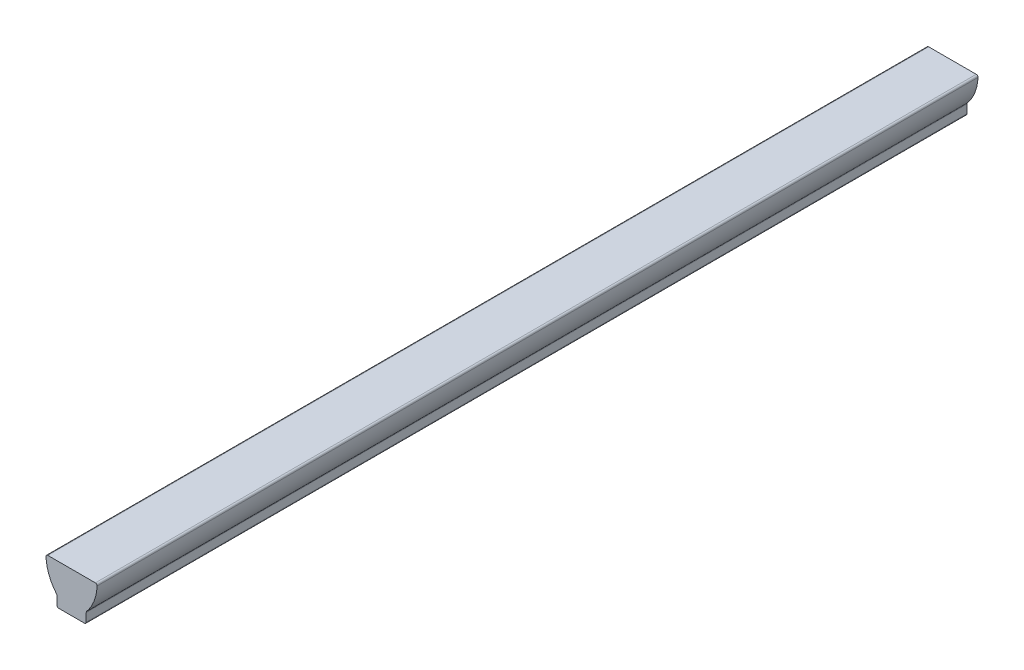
ISO-10303-21;
HEADER;
FILE_DESCRIPTION(('STEP AP214'),'2;1');
FILE_NAME('part.step','',(''),(''),'','','');
FILE_SCHEMA(('AUTOMOTIVE_DESIGN { 1 0 10303 214 1 1 1 1 }'));
ENDSEC;
DATA;
#1=APPLICATION_CONTEXT('core data for automotive mechanical design processes');
#2=APPLICATION_PROTOCOL_DEFINITION('international standard','automotive_design',2000,#1);
#3=PRODUCT_CONTEXT('',#1,'mechanical');
#4=PRODUCT('Part','Part','',(#3));
#5=PRODUCT_RELATED_PRODUCT_CATEGORY('part','',(#4));
#6=PRODUCT_DEFINITION_FORMATION('','',#4);
#7=PRODUCT_DEFINITION_CONTEXT('part definition',#1,'design');
#8=PRODUCT_DEFINITION('design','',#6,#7);
#9=PRODUCT_DEFINITION_SHAPE('','',#8);
#10=(LENGTH_UNIT() NAMED_UNIT(*) SI_UNIT(.MILLI.,.METRE.));
#11=(NAMED_UNIT(*) PLANE_ANGLE_UNIT() SI_UNIT($,.RADIAN.));
#12=(NAMED_UNIT(*) SI_UNIT($,.STERADIAN.) SOLID_ANGLE_UNIT());
#13=UNCERTAINTY_MEASURE_WITH_UNIT(LENGTH_MEASURE(1.E-05),#10,'distance_accuracy_value','');
#14=(GEOMETRIC_REPRESENTATION_CONTEXT(3) GLOBAL_UNCERTAINTY_ASSIGNED_CONTEXT((#13)) GLOBAL_UNIT_ASSIGNED_CONTEXT((#10,
#11,#12)) REPRESENTATION_CONTEXT('',''));
#15=CARTESIAN_POINT('',(0.,0.,0.));
#16=DIRECTION('',(0.,0.,1.));
#17=DIRECTION('',(1.,0.,0.));
#18=AXIS2_PLACEMENT_3D('',#15,#16,#17);
#19=CARTESIAN_POINT('',(-3.55599995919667,-5.0532017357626,190.5));
#20=DIRECTION('',(0.,0.,-1.));
#21=DIRECTION('',(-1.,0.,0.));
#22=AXIS2_PLACEMENT_3D('',#19,#20,#21);
#23=CYLINDRICAL_SURFACE('',#22,0.380999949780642);
#24=DIRECTION('',(0.,0.,1.));
#25=VECTOR('',#24,1.);
#26=CARTESIAN_POINT('',(-3.17500000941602,-5.0532017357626,95.25));
#27=LINE('',#26,#25);
#28=CARTESIAN_POINT('',(-3.17500000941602,-5.0532017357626,0.));
#29=VERTEX_POINT('',#28);
#30=CARTESIAN_POINT('',(-3.17500000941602,-5.0532017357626,190.5));
#31=VERTEX_POINT('',#30);
#32=EDGE_CURVE('E115',#29,#31,#27,.T.);
#33=ORIENTED_EDGE('',*,*,#32,.T.);
#34=CARTESIAN_POINT('',(-3.55599995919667,-5.0532017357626,190.5));
#35=DIRECTION('',(0.,0.,-1.));
#36=DIRECTION('',(-1.,0.,0.));
#37=AXIS2_PLACEMENT_3D('',#34,#35,#36);
#38=CIRCLE('',#37,0.380999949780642);
#39=CARTESIAN_POINT('',(-3.26353491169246,-4.80901908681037,190.5));
#40=VERTEX_POINT('',#39);
#41=EDGE_CURVE('E18',#40,#31,#38,.T.);
#42=ORIENTED_EDGE('',*,*,#41,.F.);
#43=DIRECTION('',(0.,0.,-1.));
#44=VECTOR('',#43,1.);
#45=CARTESIAN_POINT('',(-3.26353490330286,-4.8090190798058,95.25));
#46=LINE('',#45,#44);
#47=CARTESIAN_POINT('',(-3.26353491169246,-4.80901908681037,0.));
#48=VERTEX_POINT('',#47);
#49=EDGE_CURVE('E120',#40,#48,#46,.T.);
#50=ORIENTED_EDGE('',*,*,#49,.T.);
#51=CARTESIAN_POINT('',(-3.55599995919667,-5.0532017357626,0.));
#52=DIRECTION('',(0.,0.,-1.));
#53=DIRECTION('',(-1.,0.,0.));
#54=AXIS2_PLACEMENT_3D('',#51,#52,#53);
#55=CIRCLE('',#54,0.380999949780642);
#56=EDGE_CURVE('E113',#29,#48,#55,.F.);
#57=ORIENTED_EDGE('',*,*,#56,.F.);
#58=EDGE_LOOP('',(#33,#42,#50,#57));
#59=FACE_BOUND('',#58,.T.);
#60=ADVANCED_FACE('F14',(#59),#23,.F.);
#61=CARTESIAN_POINT('',(-2.79400000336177,-7.2757636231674,190.5));
#62=CARTESIAN_POINT('',(-2.84452374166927,-7.2757636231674,190.5));
#63=CARTESIAN_POINT('',(-2.89312454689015,-7.26609633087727,190.5));
#64=CARTESIAN_POINT('',(-2.93980239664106,-7.2467617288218,190.5));
#65=CARTESIAN_POINT('',(-2.98648024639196,-7.22742712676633,190.5));
#66=CARTESIAN_POINT('',(-3.02768201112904,-7.19989697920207,190.5));
#67=CARTESIAN_POINT('',(-3.0634076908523,-7.1641713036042,190.5));
#68=CARTESIAN_POINT('',(-3.09913337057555,-7.12844562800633,190.5));
#69=CARTESIAN_POINT('',(-3.12666351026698,-7.0872438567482,190.5));
#70=CARTESIAN_POINT('',(-3.1459981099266,-7.040566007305,190.5));
#71=CARTESIAN_POINT('',(-3.16533270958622,-6.9938881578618,190.5));
#72=CARTESIAN_POINT('',(-3.17500000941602,-6.9452873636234,190.5));
#73=CARTESIAN_POINT('',(-3.17500000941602,-6.8947636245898,190.5));
#74=CARTESIAN_POINT('',(-2.79400000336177,-7.2757636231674,0.));
#75=CARTESIAN_POINT('',(-2.84452374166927,-7.2757636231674,0.));
#76=CARTESIAN_POINT('',(-2.89312454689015,-7.26609633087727,0.));
#77=CARTESIAN_POINT('',(-2.93980239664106,-7.2467617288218,0.));
#78=CARTESIAN_POINT('',(-2.98648024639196,-7.22742712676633,0.));
#79=CARTESIAN_POINT('',(-3.02768201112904,-7.19989697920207,0.));
#80=CARTESIAN_POINT('',(-3.0634076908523,-7.1641713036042,0.));
#81=CARTESIAN_POINT('',(-3.09913337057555,-7.12844562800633,0.));
#82=CARTESIAN_POINT('',(-3.12666351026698,-7.0872438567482,0.));
#83=CARTESIAN_POINT('',(-3.1459981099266,-7.040566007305,0.));
#84=CARTESIAN_POINT('',(-3.16533270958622,-6.9938881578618,0.));
#85=CARTESIAN_POINT('',(-3.17500000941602,-6.9452873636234,0.));
#86=CARTESIAN_POINT('',(-3.17500000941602,-6.8947636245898,0.));
#87=B_SPLINE_SURFACE_WITH_KNOTS('',1,3,((#61,#62,#63,#64,#65,#66,#67,#68,#69,#70,#71,#72,#73),
(#74,#75,#76,#77,#78,#79,#80,#81,#82,#83,#84,#85,#86)),.UNSPECIFIED.,.F.,.F.,.F.,(2,2),(4,3,3,3,
4),(0.,1.),(0.,0.25,0.5,0.75,1.),.UNSPECIFIED.);
#88=DIRECTION('',(0.,0.,1.));
#89=VECTOR('',#88,1.);
#90=CARTESIAN_POINT('',(-2.79400000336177,-7.2757636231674,95.25));
#91=LINE('',#90,#89);
#92=CARTESIAN_POINT('',(-2.79400000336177,-7.2757636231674,0.));
#93=VERTEX_POINT('',#92);
#94=CARTESIAN_POINT('',(-2.79400000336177,-7.2757636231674,190.5));
#95=VERTEX_POINT('',#94);
#96=EDGE_CURVE('E152',#93,#95,#91,.T.);
#97=CARTESIAN_POINT('',(-3.17500000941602,-6.8947636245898,190.5));
#98=CARTESIAN_POINT('',(-3.17500459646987,-6.90550721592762,190.5));
#99=CARTESIAN_POINT('',(-3.17456316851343,-6.91625275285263,190.5));
#100=CARTESIAN_POINT('',(-3.1727767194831,-6.93766409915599,190.5));
#101=CARTESIAN_POINT('',(-3.17143203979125,-6.94832993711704,190.5));
#102=CARTESIAN_POINT('',(-3.16782862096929,-6.96950018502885,190.5));
#103=CARTESIAN_POINT('',(-3.16557042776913,-6.98000468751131,190.5));
#104=CARTESIAN_POINT('',(-3.16016026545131,-7.00078144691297,190.5));
#105=CARTESIAN_POINT('',(-3.15700819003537,-7.01105367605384,190.5));
#106=CARTESIAN_POINT('',(-3.14986010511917,-7.03130096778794,190.5));
#107=CARTESIAN_POINT('',(-3.14586402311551,-7.04127600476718,190.5));
#108=CARTESIAN_POINT('',(-3.1370710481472,-7.06086342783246,190.5));
#109=CARTESIAN_POINT('',(-3.13227420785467,-7.07047583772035,190.5));
#110=CARTESIAN_POINT('',(-3.11666703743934,-7.09863357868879,190.5));
#111=CARTESIAN_POINT('',(-3.10463268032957,-7.11652064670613,190.5));
#112=CARTESIAN_POINT('',(-3.07776337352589,-7.14995261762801,190.5));
#113=CARTESIAN_POINT('',(-3.06293512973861,-7.16550297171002,190.5));
#114=CARTESIAN_POINT('',(-3.03090748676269,-7.19395789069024,190.5));
#115=CARTESIAN_POINT('',(-3.01370753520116,-7.20686183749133,190.5));
#116=CARTESIAN_POINT('',(-2.9772921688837,-7.22953660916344,190.5));
#117=CARTESIAN_POINT('',(-2.95807117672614,-7.23929844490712,190.5));
#118=CARTESIAN_POINT('',(-2.91830204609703,-7.2555552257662,190.5));
#119=CARTESIAN_POINT('',(-2.89775477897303,-7.2620522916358,190.5));
#120=CARTESIAN_POINT('',(-2.86322192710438,-7.26975959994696,190.5));
#121=CARTESIAN_POINT('',(-2.84946549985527,-7.27202515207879,190.5));
#122=CARTESIAN_POINT('',(-2.82180573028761,-7.27503135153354,190.5));
#123=CARTESIAN_POINT('',(-2.80790261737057,-7.27577410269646,190.5));
#124=CARTESIAN_POINT('',(-2.79400000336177,-7.2757636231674,190.5));
#125=B_SPLINE_CURVE_WITH_KNOTS('',3,(#97,#98,#99,#100,#101,#102,#103,#104,#105,#106,#107,#108,
#109,#110,#111,#112,#113,#114,#115,#116,#117,#118,#119,#120,#121,#122,#123,#124),.UNSPECIFIED.,
.F.,.F.,(4,2,2,2,2,2,2,2,2,2,2,2,2,4),(0.,0.0322242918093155,0.0644364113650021,
0.0966293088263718,0.128826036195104,0.16102553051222,0.19322290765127,0.257551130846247,
0.321726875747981,0.385917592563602,0.450290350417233,0.514621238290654,0.556364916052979,
0.598050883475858),.UNSPECIFIED.);
#126=CARTESIAN_POINT('',(-3.17500000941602,-6.8947636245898,190.5));
#127=VERTEX_POINT('',#126);
#128=EDGE_CURVE('E264',#127,#95,#125,.T.);
#129=DIRECTION('',(0.,0.,-1.));
#130=VECTOR('',#129,1.);
#131=CARTESIAN_POINT('',(-3.17500000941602,-6.8947636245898,95.25));
#132=LINE('',#131,#130);
#133=CARTESIAN_POINT('',(-3.17500000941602,-6.8947636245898,0.));
#134=VERTEX_POINT('',#133);
#135=EDGE_CURVE('E119',#127,#134,#132,.T.);
#136=CARTESIAN_POINT('',(-2.79400000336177,-7.2757636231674,0.));
#137=CARTESIAN_POINT('',(-2.80474359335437,-7.27576821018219,0.));
#138=CARTESIAN_POINT('',(-2.81548912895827,-7.27532678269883,0.));
#139=CARTESIAN_POINT('',(-2.83690047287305,-7.27354033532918,0.));
#140=CARTESIAN_POINT('',(-2.84756630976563,-7.27219565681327,0.));
#141=CARTESIAN_POINT('',(-2.8687365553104,-7.26859224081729,0.));
#142=CARTESIAN_POINT('',(-2.87924105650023,-7.26633404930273,0.));
#143=CARTESIAN_POINT('',(-2.90001781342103,-7.26092389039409,0.));
#144=CARTESIAN_POINT('',(-2.91029004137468,-7.2577718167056,0.));
#145=CARTESIAN_POINT('',(-2.93053733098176,-7.25062373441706,0.));
#146=CARTESIAN_POINT('',(-2.94051236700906,-7.24662765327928,0.));
#147=CARTESIAN_POINT('',(-2.9600997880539,-7.23783467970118,0.));
#148=CARTESIAN_POINT('',(-2.96971219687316,-7.23303783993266,0.));
#149=CARTESIAN_POINT('',(-2.99786993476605,-7.21743067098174,0.));
#150=CARTESIAN_POINT('',(-3.01575700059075,-7.20539631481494,0.));
#151=CARTESIAN_POINT('',(-3.04918897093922,-7.17852701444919,0.));
#152=CARTESIAN_POINT('',(-3.06473932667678,-7.16369877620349,0.));
#153=CARTESIAN_POINT('',(-3.09319424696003,-7.13167114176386,0.));
#154=CARTESIAN_POINT('',(-3.10609819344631,-7.11447119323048,0.));
#155=CARTESIAN_POINT('',(-3.12877296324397,-7.0780558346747,0.));
#156=CARTESIAN_POINT('',(-3.13853479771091,-7.05883484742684,0.));
#157=CARTESIAN_POINT('',(-3.15479158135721,-7.01906572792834,0.));
#158=CARTESIAN_POINT('',(-3.16128865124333,-6.99851846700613,0.));
#159=CARTESIAN_POINT('',(-3.16899597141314,-6.96398560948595,0.));
#160=CARTESIAN_POINT('',(-3.17126152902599,-6.9502291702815,0.));
#161=CARTESIAN_POINT('',(-3.17426773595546,-6.92256937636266,0.));
#162=CARTESIAN_POINT('',(-3.1750104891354,-6.90866625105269,0.));
#163=CARTESIAN_POINT('',(-3.17500000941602,-6.8947636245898,0.));
#164=B_SPLINE_CURVE_WITH_KNOTS('',3,(#136,#137,#138,#139,#140,#141,#142,#143,#144,#145,#146,
#147,#148,#149,#150,#151,#152,#153,#154,#155,#156,#157,#158,#159,#160,#161,#162,#163),
.UNSPECIFIED.,.F.,.F.,(4,2,2,2,2,2,2,2,2,2,2,2,2,4),(0.,0.0322242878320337,0.0644364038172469,
0.0966292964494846,0.128826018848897,0.161025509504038,0.193222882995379,0.257551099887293,
0.321726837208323,0.385917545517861,0.450290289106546,0.514621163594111,0.556364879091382,
0.598050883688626),.UNSPECIFIED.);
#165=EDGE_CURVE('E258',#93,#134,#164,.T.);
#166=ORIENTED_EDGE('',*,*,#96,.T.);
#167=ORIENTED_EDGE('',*,*,#128,.F.);
#168=ORIENTED_EDGE('',*,*,#135,.T.);
#169=ORIENTED_EDGE('',*,*,#165,.F.);
#170=EDGE_LOOP('',(#166,#167,#168,#169));
#171=FACE_BOUND('',#170,.T.);
#172=ADVANCED_FACE('F233',(#171),#87,.F.);
#173=CARTESIAN_POINT('',(3.17500000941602,-6.8947636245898,190.5));
#174=CARTESIAN_POINT('',(3.17500000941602,-6.9452873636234,190.5));
#175=CARTESIAN_POINT('',(3.16533270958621,-6.99388815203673,190.5));
#176=CARTESIAN_POINT('',(3.1459981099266,-7.040566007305,190.5));
#177=CARTESIAN_POINT('',(3.12666351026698,-7.08724386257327,190.5));
#178=CARTESIAN_POINT('',(3.09913337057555,-7.12844562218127,190.5));
#179=CARTESIAN_POINT('',(3.0634076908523,-7.1641713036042,190.5));
#180=CARTESIAN_POINT('',(3.02768201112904,-7.19989698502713,190.5));
#181=CARTESIAN_POINT('',(2.98648025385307,-7.2274271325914,190.5));
#182=CARTESIAN_POINT('',(2.93980239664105,-7.2467617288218,190.5));
#183=CARTESIAN_POINT('',(2.89312453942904,-7.2660963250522,190.5));
#184=CARTESIAN_POINT('',(2.84452374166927,-7.2757636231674,190.5));
#185=CARTESIAN_POINT('',(2.79400000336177,-7.2757636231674,190.5));
#186=CARTESIAN_POINT('',(3.17500000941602,-6.8947636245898,0.));
#187=CARTESIAN_POINT('',(3.17500000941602,-6.9452873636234,0.));
#188=CARTESIAN_POINT('',(3.16533270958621,-6.99388815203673,0.));
#189=CARTESIAN_POINT('',(3.1459981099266,-7.040566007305,0.));
#190=CARTESIAN_POINT('',(3.12666351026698,-7.08724386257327,0.));
#191=CARTESIAN_POINT('',(3.09913337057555,-7.12844562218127,0.));
#192=CARTESIAN_POINT('',(3.0634076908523,-7.1641713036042,0.));
#193=CARTESIAN_POINT('',(3.02768201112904,-7.19989698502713,0.));
#194=CARTESIAN_POINT('',(2.98648025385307,-7.2274271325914,0.));
#195=CARTESIAN_POINT('',(2.93980239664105,-7.2467617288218,0.));
#196=CARTESIAN_POINT('',(2.89312453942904,-7.2660963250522,0.));
#197=CARTESIAN_POINT('',(2.84452374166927,-7.2757636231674,0.));
#198=CARTESIAN_POINT('',(2.79400000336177,-7.2757636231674,0.));
#199=B_SPLINE_SURFACE_WITH_KNOTS('',1,3,((#173,#174,#175,#176,#177,#178,#179,#180,#181,#182,
#183,#184,#185),(#186,#187,#188,#189,#190,#191,#192,#193,#194,#195,#196,#197,#198)),
.UNSPECIFIED.,.F.,.F.,.F.,(2,2),(4,3,3,3,4),(0.,1.),(0.,0.25,0.5,0.75,1.),.UNSPECIFIED.);
#200=DIRECTION('',(0.,0.,1.));
#201=VECTOR('',#200,1.);
#202=CARTESIAN_POINT('',(3.17500000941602,-6.8947636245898,95.25));
#203=LINE('',#202,#201);
#204=CARTESIAN_POINT('',(3.17500000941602,-6.8947636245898,0.));
#205=VERTEX_POINT('',#204);
#206=CARTESIAN_POINT('',(3.17500000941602,-6.8947636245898,190.5));
#207=VERTEX_POINT('',#206);
#208=EDGE_CURVE('E146',#205,#207,#203,.T.);
#209=CARTESIAN_POINT('',(2.79400000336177,-7.2757636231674,190.5));
#210=CARTESIAN_POINT('',(2.80474359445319,-7.27576821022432,190.5));
#211=CARTESIAN_POINT('',(2.81548913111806,-7.27532678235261,190.5));
#212=CARTESIAN_POINT('',(2.83690047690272,-7.27354033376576,190.5));
#213=CARTESIAN_POINT('',(2.84756631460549,-7.27219565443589,190.5));
#214=CARTESIAN_POINT('',(2.86873656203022,-7.26859223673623,190.5));
#215=CARTESIAN_POINT('',(2.87924106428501,-7.26633404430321,190.5));
#216=CARTESIAN_POINT('',(2.90001782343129,-7.26092388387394,190.5));
#217=CARTESIAN_POINT('',(2.91029005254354,-7.2577718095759,190.5));
#218=CARTESIAN_POINT('',(2.93053734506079,-7.25062372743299,190.5));
#219=CARTESIAN_POINT('',(2.94051238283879,-7.24662764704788,190.5));
#220=CARTESIAN_POINT('',(2.96009980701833,-7.23783467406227,190.5));
#221=CARTESIAN_POINT('',(2.96971221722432,-7.23303783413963,190.5));
#222=CARTESIAN_POINT('',(2.99786995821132,-7.21743066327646,190.5));
#223=CARTESIAN_POINT('',(3.01575702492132,-7.20539630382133,190.5));
#224=CARTESIAN_POINT('',(3.04918898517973,-7.17852700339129,190.5));
#225=CARTESIAN_POINT('',(3.0647393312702,-7.16369877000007,190.5));
#226=CARTESIAN_POINT('',(3.09319423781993,-7.13167114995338,190.5));
#227=CARTESIAN_POINT('',(3.10609818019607,-7.11447121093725,190.5));
#228=CARTESIAN_POINT('',(3.12877295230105,-7.07805585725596,190.5));
#229=CARTESIAN_POINT('',(3.13853479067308,-7.0588348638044,190.5));
#230=CARTESIAN_POINT('',(3.15479158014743,-7.01906573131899,190.5));
#231=CARTESIAN_POINT('',(3.16128865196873,-6.99851846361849,190.5));
#232=CARTESIAN_POINT('',(3.1689959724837,-6.96398560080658,190.5));
#233=CARTESIAN_POINT('',(3.17126152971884,-6.9502291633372,190.5));
#234=CARTESIAN_POINT('',(3.17426773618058,-6.92256937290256,190.5));
#235=CARTESIAN_POINT('',(3.17501048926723,-6.90866624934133,190.5));
#236=CARTESIAN_POINT('',(3.17500000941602,-6.8947636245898,190.5));
#237=B_SPLINE_CURVE_WITH_KNOTS('',3,(#209,#210,#211,#212,#213,#214,#215,#216,#217,#218,#219,
#220,#221,#222,#223,#224,#225,#226,#227,#228,#229,#230,#231,#232,#233,#234,#235,#236),
.UNSPECIFIED.,.F.,.F.,(4,2,2,2,2,2,2,2,2,2,2,2,2,4),(0.,0.0322242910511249,0.0644364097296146,
0.0966293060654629,0.128826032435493,0.161025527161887,0.193222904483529,0.257551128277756,
0.321726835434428,0.385917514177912,0.450290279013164,0.514621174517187,0.556364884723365,
0.598050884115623),.UNSPECIFIED.);
#238=CARTESIAN_POINT('',(2.79400000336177,-7.2757636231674,190.5));
#239=VERTEX_POINT('',#238);
#240=EDGE_CURVE('E220',#239,#207,#237,.T.);
#241=DIRECTION('',(0.,0.,-1.));
#242=VECTOR('',#241,1.);
#243=CARTESIAN_POINT('',(2.79400000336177,-7.2757636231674,95.25));
#244=LINE('',#243,#242);
#245=CARTESIAN_POINT('',(2.79400000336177,-7.2757636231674,0.));
#246=VERTEX_POINT('',#245);
#247=EDGE_CURVE('E149',#239,#246,#244,.T.);
#248=CARTESIAN_POINT('',(3.17500000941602,-6.8947636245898,0.));
#249=CARTESIAN_POINT('',(3.17500459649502,-6.90550721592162,0.));
#250=CARTESIAN_POINT('',(3.17456316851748,-6.9162527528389,0.));
#251=CARTESIAN_POINT('',(3.1727767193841,-6.93766409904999,0.));
#252=CARTESIAN_POINT('',(3.17143203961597,-6.94832993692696,0.));
#253=CARTESIAN_POINT('',(3.16782862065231,-6.9695001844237,0.));
#254=CARTESIAN_POINT('',(3.16557042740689,-6.98000468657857,0.));
#255=CARTESIAN_POINT('',(3.16016026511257,-7.00078144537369,0.));
#256=CARTESIAN_POINT('',(3.15700818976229,-7.0110536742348,0.));
#257=CARTESIAN_POINT('',(3.14986010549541,-7.03130096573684,0.));
#258=CARTESIAN_POINT('',(3.1458640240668,-7.04127600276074,0.));
#259=CARTESIAN_POINT('',(3.13707104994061,-7.06086342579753,0.));
#260=CARTESIAN_POINT('',(3.13227420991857,-7.07047583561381,0.));
#261=CARTESIAN_POINT('',(3.11666703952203,-7.09863357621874,0.));
#262=CARTESIAN_POINT('',(3.1046326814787,-7.11652064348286,0.));
#263=CARTESIAN_POINT('',(3.07776337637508,-7.14995261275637,0.));
#264=CARTESIAN_POINT('',(3.06293513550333,-7.16550296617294,0.));
#265=CARTESIAN_POINT('',(3.03090749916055,-7.1939578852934,0.));
#266=CARTESIAN_POINT('',(3.01370755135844,-7.20686183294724,0.));
#267=CARTESIAN_POINT('',(2.97729218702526,-7.22953660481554,0.));
#268=CARTESIAN_POINT('',(2.95807119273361,-7.23929843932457,0.));
#269=CARTESIAN_POINT('',(2.91830205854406,-7.25555521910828,0.));
#270=CARTESIAN_POINT('',(2.8977547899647,-7.26205228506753,0.));
#271=CARTESIAN_POINT('',(2.86322193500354,-7.26975959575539,0.));
#272=CARTESIAN_POINT('',(2.84946550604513,-7.27202514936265,0.));
#273=CARTESIAN_POINT('',(2.82180573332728,-7.27503135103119,0.));
#274=CARTESIAN_POINT('',(2.80790261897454,-7.27577410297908,0.));
#275=CARTESIAN_POINT('',(2.79400000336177,-7.2757636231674,0.));
#276=B_SPLINE_CURVE_WITH_KNOTS('',3,(#248,#249,#250,#251,#252,#253,#254,#255,#256,#257,#258,
#259,#260,#261,#262,#263,#264,#265,#266,#267,#268,#269,#270,#271,#272,#273,#274,#275),
.UNSPECIFIED.,.F.,.F.,(4,2,2,2,2,2,2,2,2,2,2,2,2,4),(0.,0.0322242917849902,0.0644364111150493,
0.0966293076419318,0.128826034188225,0.161025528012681,0.19322290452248,0.257551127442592,
0.321726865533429,0.385917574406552,0.450290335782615,0.514621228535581,0.556364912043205,
0.598050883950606),.UNSPECIFIED.);
#277=EDGE_CURVE('E211',#205,#246,#276,.T.);
#278=ORIENTED_EDGE('',*,*,#208,.T.);
#279=ORIENTED_EDGE('',*,*,#240,.F.);
#280=ORIENTED_EDGE('',*,*,#247,.T.);
#281=ORIENTED_EDGE('',*,*,#277,.F.);
#282=EDGE_LOOP('',(#278,#279,#280,#281));
#283=FACE_BOUND('',#282,.T.);
#284=ADVANCED_FACE('F226',(#283),#199,.F.);
#285=CARTESIAN_POINT('',(3.55600003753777,-5.05320171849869,190.5));
#286=DIRECTION('',(-5.54148140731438E-13,2.00921079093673E-13,-1.));
#287=DIRECTION('',(-1.,0.,5.54148140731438E-13));
#288=AXIS2_PLACEMENT_3D('',#285,#286,#287);
#289=CYLINDRICAL_SURFACE('',#288,0.381000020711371);
#290=DIRECTION('',(0.,0.,1.));
#291=VECTOR('',#290,1.);
#292=CARTESIAN_POINT('',(3.26353490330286,-4.8090190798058,95.25));
#293=LINE('',#292,#291);
#294=CARTESIAN_POINT('',(3.26353490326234,-4.80901907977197,0.));
#295=VERTEX_POINT('',#294);
#296=CARTESIAN_POINT('',(3.26353490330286,-4.8090190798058,190.5));
#297=VERTEX_POINT('',#296);
#298=EDGE_CURVE('E142',#295,#297,#293,.T.);
#299=ORIENTED_EDGE('',*,*,#298,.T.);
#300=CARTESIAN_POINT('',(3.55600003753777,-5.05320171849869,190.5));
#301=DIRECTION('',(-5.54148140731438E-13,2.00921079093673E-13,-1.));
#302=DIRECTION('',(-1.,0.,5.54148140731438E-13));
#303=AXIS2_PLACEMENT_3D('',#300,#301,#302);
#304=CIRCLE('',#303,0.381000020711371);
#305=CARTESIAN_POINT('',(3.17500000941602,-5.05320172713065,190.5));
#306=VERTEX_POINT('',#305);
#307=EDGE_CURVE('E219',#306,#297,#304,.T.);
#308=ORIENTED_EDGE('',*,*,#307,.F.);
#309=DIRECTION('',(0.,0.,-1.));
#310=VECTOR('',#309,1.);
#311=CARTESIAN_POINT('',(3.17500000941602,-5.0532017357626,95.25));
#312=LINE('',#311,#310);
#313=CARTESIAN_POINT('',(3.17500000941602,-5.05320172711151,0.));
#314=VERTEX_POINT('',#313);
#315=EDGE_CURVE('E145',#306,#314,#312,.T.);
#316=ORIENTED_EDGE('',*,*,#315,.T.);
#317=CARTESIAN_POINT('',(3.5560000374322,-5.05320171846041,-2.22044604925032E-13));
#318=DIRECTION('',(-5.54148140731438E-13,2.00921079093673E-13,-1.));
#319=DIRECTION('',(-1.,0.,5.54148140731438E-13));
#320=AXIS2_PLACEMENT_3D('',#317,#318,#319);
#321=CIRCLE('',#320,0.381000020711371);
#322=EDGE_CURVE('E167',#295,#314,#321,.F.);
#323=ORIENTED_EDGE('',*,*,#322,.F.);
#324=EDGE_LOOP('',(#299,#308,#316,#323));
#325=FACE_BOUND('',#324,.T.);
#326=ADVANCED_FACE('F232',(#325),#289,.F.);
#327=CARTESIAN_POINT('',(-5.52916549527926,1.0653994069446,190.5));
#328=DIRECTION('',(0.999794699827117,0.0202622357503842,0.));
#329=DIRECTION('',(0.,0.,-1.));
#330=AXIS2_PLACEMENT_3D('',#327,#328,#329);
#331=PLANE('',#330);
#332=DIRECTION('',(0.,0.,1.));
#333=VECTOR('',#332,1.);
#334=CARTESIAN_POINT('',(-5.52916549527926,1.0653994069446,95.25));
#335=LINE('',#334,#333);
#336=CARTESIAN_POINT('',(-5.52916549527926,1.0653994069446,0.));
#337=VERTEX_POINT('',#336);
#338=CARTESIAN_POINT('',(-5.52916549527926,1.0653994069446,190.5));
#339=VERTEX_POINT('',#338);
#340=EDGE_CURVE('E159',#337,#339,#335,.T.);
#341=ORIENTED_EDGE('',*,*,#340,.T.);
#342=DIRECTION('',(-0.0202622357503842,0.999794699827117,0.));
#343=VECTOR('',#342,1.);
#344=CARTESIAN_POINT('',(-5.52916549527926,1.0653994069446,190.5));
#345=LINE('',#344,#343);
#346=CARTESIAN_POINT('',(-5.52947834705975,1.080836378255,190.5));
#347=VERTEX_POINT('',#346);
#348=EDGE_CURVE('E127',#339,#347,#345,.T.);
#349=ORIENTED_EDGE('',*,*,#348,.T.);
#350=DIRECTION('',(0.,0.,-1.));
#351=VECTOR('',#350,1.);
#352=CARTESIAN_POINT('',(-5.52947834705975,1.080836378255,95.25));
#353=LINE('',#352,#351);
#354=CARTESIAN_POINT('',(-5.52947834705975,1.080836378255,0.));
#355=VERTEX_POINT('',#354);
#356=EDGE_CURVE('E162',#347,#355,#353,.T.);
#357=ORIENTED_EDGE('',*,*,#356,.T.);
#358=DIRECTION('',(-0.0202622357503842,0.999794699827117,0.));
#359=VECTOR('',#358,1.);
#360=CARTESIAN_POINT('',(-5.52932192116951,1.0731178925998,0.));
#361=LINE('',#360,#359);
#362=EDGE_CURVE('E161',#337,#355,#361,.T.);
#363=ORIENTED_EDGE('',*,*,#362,.F.);
#364=EDGE_LOOP('',(#341,#349,#357,#363));
#365=FACE_BOUND('',#364,.T.);
#366=ADVANCED_FACE('F418',(#365),#331,.F.);
#367=CARTESIAN_POINT('',(-3.26353490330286,-4.8090190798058,190.5));
#368=CARTESIAN_POINT('',(-3.60666026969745,-4.3980472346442,190.5));
#369=CARTESIAN_POINT('',(-3.91398432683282,-3.96185139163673,190.5));
#370=CARTESIAN_POINT('',(-4.18550709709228,-3.5004315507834,190.5));
#371=CARTESIAN_POINT('',(-4.45702986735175,-3.03901170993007,190.5));
#372=CARTESIAN_POINT('',(-4.68911758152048,-2.5585429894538,190.5));
#373=CARTESIAN_POINT('',(-4.88177023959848,-2.0590253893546,190.5));
#374=CARTESIAN_POINT('',(-5.07442289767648,-1.5595077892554,190.5));
#375=CARTESIAN_POINT('',(-5.22506227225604,-1.04762628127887,190.5));
#376=CARTESIAN_POINT('',(-5.33368834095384,-0.523380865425,190.5));
#377=CARTESIAN_POINT('',(-5.44231440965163,0.000864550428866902,190.5));
#378=CARTESIAN_POINT('',(-5.50747346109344,0.530457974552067,190.5));
#379=CARTESIAN_POINT('',(-5.52916549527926,1.0653994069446,190.5));
#380=CARTESIAN_POINT('',(-3.26353490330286,-4.8090190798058,0.));
#381=CARTESIAN_POINT('',(-3.60666026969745,-4.3980472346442,0.));
#382=CARTESIAN_POINT('',(-3.91398432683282,-3.96185139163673,0.));
#383=CARTESIAN_POINT('',(-4.18550709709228,-3.5004315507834,0.));
#384=CARTESIAN_POINT('',(-4.45702986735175,-3.03901170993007,0.));
#385=CARTESIAN_POINT('',(-4.68911758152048,-2.5585429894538,0.));
#386=CARTESIAN_POINT('',(-4.88177023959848,-2.0590253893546,0.));
#387=CARTESIAN_POINT('',(-5.07442289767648,-1.5595077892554,0.));
#388=CARTESIAN_POINT('',(-5.22506227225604,-1.04762628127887,0.));
#389=CARTESIAN_POINT('',(-5.33368834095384,-0.523380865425,0.));
#390=CARTESIAN_POINT('',(-5.44231440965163,0.000864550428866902,0.));
#391=CARTESIAN_POINT('',(-5.50747346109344,0.530457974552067,0.));
#392=CARTESIAN_POINT('',(-5.52916549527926,1.0653994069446,0.));
#393=B_SPLINE_SURFACE_WITH_KNOTS('',1,3,((#367,#368,#369,#370,#371,#372,#373,#374,#375,#376,
#377,#378,#379),(#380,#381,#382,#383,#384,#385,#386,#387,#388,#389,#390,#391,#392)),
.UNSPECIFIED.,.F.,.F.,.F.,(2,2),(4,3,3,3,4),(0.,1.),(0.,0.25,0.5,0.75,1.),.UNSPECIFIED.);
#394=CARTESIAN_POINT('',(-3.26353490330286,-4.8090190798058,190.5));
#395=CARTESIAN_POINT('',(-3.34973877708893,-4.7057760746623,190.5));
#396=CARTESIAN_POINT('',(-3.4338127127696,-4.60077262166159,190.5));
#397=CARTESIAN_POINT('',(-3.59755682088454,-4.38739201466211,190.5));
#398=CARTESIAN_POINT('',(-3.6772271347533,-4.27901496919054,190.5));
#399=CARTESIAN_POINT('',(-3.90931565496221,-3.94918939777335,190.5));
#400=CARTESIAN_POINT('',(-4.05493354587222,-3.72290025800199,190.5));
#401=CARTESIAN_POINT('',(-4.32712751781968,-3.25916624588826,190.5));
#402=CARTESIAN_POINT('',(-4.45370260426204,-3.02172079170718,190.5));
#403=CARTESIAN_POINT('',(-4.68682387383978,-2.53706461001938,190.5));
#404=CARTESIAN_POINT('',(-4.79336189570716,-2.2898499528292,190.5));
#405=CARTESIAN_POINT('',(-4.98430375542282,-1.79146865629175,190.5));
#406=CARTESIAN_POINT('',(-5.06902894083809,-1.54042506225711,190.5));
#407=CARTESIAN_POINT('',(-5.217771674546,-1.03216877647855,190.5));
#408=CARTESIAN_POINT('',(-5.28178050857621,-0.774953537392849,190.5));
#409=CARTESIAN_POINT('',(-5.38902457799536,-0.255226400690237,190.5));
#410=CARTESIAN_POINT('',(-5.43218384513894,0.00730128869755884,190.5));
#411=CARTESIAN_POINT('',(-5.48070148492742,0.402974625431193,190.5));
#412=CARTESIAN_POINT('',(-5.49417011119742,0.535170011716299,190.5));
#413=CARTESIAN_POINT('',(-5.51571212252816,0.800002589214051,190.5));
#414=CARTESIAN_POINT('',(-5.52378539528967,0.932639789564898,190.5));
#415=CARTESIAN_POINT('',(-5.52916549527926,1.0653994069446,190.5));
#416=B_SPLINE_CURVE_WITH_KNOTS('',3,(#394,#395,#396,#397,#398,#399,#400,#401,#402,#403,#404,
#405,#406,#407,#408,#409,#410,#411,#412,#413,#414,#415),.UNSPECIFIED.,.F.,.F.,(4,2,2,2,2,2,2,2,
2,2,4),(0.,0.403443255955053,0.80687354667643,1.61316450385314,2.41949755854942,
3.22615833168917,4.02015017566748,4.81447557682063,5.61167378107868,6.01021685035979,
6.40876821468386),.UNSPECIFIED.);
#417=EDGE_CURVE('E112',#40,#339,#416,.T.);
#418=CARTESIAN_POINT('',(-5.52916549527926,1.0653994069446,0.));
#419=CARTESIAN_POINT('',(-5.52371982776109,0.931009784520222,0.));
#420=CARTESIAN_POINT('',(-5.51551372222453,0.796745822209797,0.));
#421=CARTESIAN_POINT('',(-5.49357284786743,0.52867490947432,0.));
#422=CARTESIAN_POINT('',(-5.47983825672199,0.394867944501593,0.));
#423=CARTESIAN_POINT('',(-5.43035258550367,-0.00538342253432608,0.));
#424=CARTESIAN_POINT('',(-5.38631193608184,-0.270848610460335,0.));
#425=CARTESIAN_POINT('',(-5.27662933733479,-0.797259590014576,0.));
#426=CARTESIAN_POINT('',(-5.21098626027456,-1.05820514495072,0.));
#427=CARTESIAN_POINT('',(-5.05830101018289,-1.5738836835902,0.));
#428=CARTESIAN_POINT('',(-4.9712501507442,-1.82861409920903,0.));
#429=CARTESIAN_POINT('',(-4.77809274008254,-2.32614090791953,0.));
#430=CARTESIAN_POINT('',(-4.67230693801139,-2.56906189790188,0.));
#431=CARTESIAN_POINT('',(-4.44124801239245,-3.04557068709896,0.));
#432=CARTESIAN_POINT('',(-4.31596672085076,-3.27915452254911,0.));
#433=CARTESIAN_POINT('',(-4.04645376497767,-3.73629821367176,0.));
#434=CARTESIAN_POINT('',(-3.90215520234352,-3.95981876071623,0.));
#435=CARTESIAN_POINT('',(-3.67242337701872,-4.28560187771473,0.));
#436=CARTESIAN_POINT('',(-3.59363811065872,-4.3926061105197,0.));
#437=CARTESIAN_POINT('',(-3.43177289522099,-4.60331919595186,0.));
#438=CARTESIAN_POINT('',(-3.34869285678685,-4.70702797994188,0.));
#439=CARTESIAN_POINT('',(-3.26353490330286,-4.8090190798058,0.));
#440=B_SPLINE_CURVE_WITH_KNOTS('',3,(#418,#419,#420,#421,#422,#423,#424,#425,#426,#427,#428,
#429,#430,#431,#432,#433,#434,#435,#436,#437,#438,#439),.UNSPECIFIED.,.F.,.F.,(4,2,2,2,2,2,2,2,
2,2,4),(0.,0.403443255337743,0.806873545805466,1.61316450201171,2.41949755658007,
3.22615832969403,4.02015017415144,4.81447557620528,5.61167378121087,6.01021685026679,
6.40876821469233),.UNSPECIFIED.);
#441=EDGE_CURVE('E181',#337,#48,#440,.T.);
#442=ORIENTED_EDGE('',*,*,#49,.F.);
#443=ORIENTED_EDGE('',*,*,#417,.T.);
#444=ORIENTED_EDGE('',*,*,#340,.F.);
#445=ORIENTED_EDGE('',*,*,#441,.T.);
#446=EDGE_LOOP('',(#442,#443,#444,#445));
#447=FACE_BOUND('',#446,.T.);
#448=ADVANCED_FACE('F235',(#447),#393,.F.);
#449=CARTESIAN_POINT('',(-3.17500000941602,-6.8947636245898,190.5));
#450=DIRECTION('',(1.,0.,0.));
#451=DIRECTION('',(0.,0.,-1.));
#452=AXIS2_PLACEMENT_3D('',#449,#450,#451);
#453=PLANE('',#452);
#454=ORIENTED_EDGE('',*,*,#135,.F.);
#455=DIRECTION('',(0.,1.,0.));
#456=VECTOR('',#455,1.);
#457=CARTESIAN_POINT('',(-3.17500000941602,-2.9069636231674,190.5));
#458=LINE('',#457,#456);
#459=EDGE_CURVE('E110',#127,#31,#458,.T.);
#460=ORIENTED_EDGE('',*,*,#459,.T.);
#461=ORIENTED_EDGE('',*,*,#32,.F.);
#462=DIRECTION('',(0.,-1.,0.));
#463=VECTOR('',#462,1.);
#464=CARTESIAN_POINT('',(-3.17500000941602,-2.9069636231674,0.));
#465=LINE('',#464,#463);
#466=EDGE_CURVE('E272',#29,#134,#465,.T.);
#467=ORIENTED_EDGE('',*,*,#466,.T.);
#468=EDGE_LOOP('',(#454,#460,#461,#467));
#469=FACE_BOUND('',#468,.T.);
#470=ADVANCED_FACE('F123',(#469),#453,.F.);
#471=CARTESIAN_POINT('',(2.79400000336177,-7.2757636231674,190.5));
#472=DIRECTION('',(0.,1.,0.));
#473=DIRECTION('',(0.,0.,-1.));
#474=AXIS2_PLACEMENT_3D('',#471,#472,#473);
#475=PLANE('',#474);
#476=ORIENTED_EDGE('',*,*,#247,.F.);
#477=DIRECTION('',(-1.,0.,0.));
#478=VECTOR('',#477,1.);
#479=CARTESIAN_POINT('',(0.0553914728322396,-7.2757636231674,190.5));
#480=LINE('',#479,#478);
#481=EDGE_CURVE('E125',#239,#95,#480,.T.);
#482=ORIENTED_EDGE('',*,*,#481,.T.);
#483=ORIENTED_EDGE('',*,*,#96,.F.);
#484=DIRECTION('',(1.,0.,0.));
#485=VECTOR('',#484,1.);
#486=CARTESIAN_POINT('',(0.0553914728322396,-7.2757636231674,0.));
#487=LINE('',#486,#485);
#488=EDGE_CURVE('E275',#93,#246,#487,.T.);
#489=ORIENTED_EDGE('',*,*,#488,.T.);
#490=EDGE_LOOP('',(#476,#482,#483,#489));
#491=FACE_BOUND('',#490,.T.);
#492=ADVANCED_FACE('F394',(#491),#475,.F.);
#493=CARTESIAN_POINT('',(3.17500000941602,-5.0532017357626,190.5));
#494=DIRECTION('',(-1.,0.,0.));
#495=DIRECTION('',(0.,0.,-1.));
#496=AXIS2_PLACEMENT_3D('',#493,#494,#495);
#497=PLANE('',#496);
#498=ORIENTED_EDGE('',*,*,#315,.F.);
#499=DIRECTION('',(0.,-1.,0.));
#500=VECTOR('',#499,1.);
#501=CARTESIAN_POINT('',(3.17500000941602,-2.9069636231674,190.5));
#502=LINE('',#501,#500);
#503=EDGE_CURVE('E130',#306,#207,#502,.T.);
#504=ORIENTED_EDGE('',*,*,#503,.T.);
#505=ORIENTED_EDGE('',*,*,#208,.F.);
#506=DIRECTION('',(0.,1.,0.));
#507=VECTOR('',#506,1.);
#508=CARTESIAN_POINT('',(3.17500000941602,-2.9069636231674,0.));
#509=LINE('',#508,#507);
#510=EDGE_CURVE('E180',#205,#314,#509,.T.);
#511=ORIENTED_EDGE('',*,*,#510,.T.);
#512=EDGE_LOOP('',(#498,#504,#505,#511));
#513=FACE_BOUND('',#512,.T.);
#514=ADVANCED_FACE('F387',(#513),#497,.F.);
#515=CARTESIAN_POINT('',(5.52916549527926,1.0653994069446,190.5));
#516=CARTESIAN_POINT('',(5.50747346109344,0.530457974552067,190.5));
#517=CARTESIAN_POINT('',(5.44231441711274,0.000864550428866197,190.5));
#518=CARTESIAN_POINT('',(5.33368834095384,-0.523380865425,190.5));
#519=CARTESIAN_POINT('',(5.22506226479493,-1.04762628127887,190.5));
#520=CARTESIAN_POINT('',(5.07442289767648,-1.5595077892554,190.5));
#521=CARTESIAN_POINT('',(4.88177023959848,-2.0590253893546,190.5));
#522=CARTESIAN_POINT('',(4.68911758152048,-2.5585429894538,190.5));
#523=CARTESIAN_POINT('',(4.45702985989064,-3.03901170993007,190.5));
#524=CARTESIAN_POINT('',(4.18550709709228,-3.5004315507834,190.5));
#525=CARTESIAN_POINT('',(3.91398433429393,-3.96185139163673,190.5));
#526=CARTESIAN_POINT('',(3.60666026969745,-4.3980472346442,190.5));
#527=CARTESIAN_POINT('',(3.26353490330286,-4.8090190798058,190.5));
#528=CARTESIAN_POINT('',(5.52916549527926,1.0653994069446,0.));
#529=CARTESIAN_POINT('',(5.50747346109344,0.530457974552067,0.));
#530=CARTESIAN_POINT('',(5.44231441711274,0.000864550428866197,0.));
#531=CARTESIAN_POINT('',(5.33368834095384,-0.523380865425,0.));
#532=CARTESIAN_POINT('',(5.22506226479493,-1.04762628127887,0.));
#533=CARTESIAN_POINT('',(5.07442289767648,-1.5595077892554,0.));
#534=CARTESIAN_POINT('',(4.88177023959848,-2.0590253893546,0.));
#535=CARTESIAN_POINT('',(4.68911758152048,-2.5585429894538,0.));
#536=CARTESIAN_POINT('',(4.45702985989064,-3.03901170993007,0.));
#537=CARTESIAN_POINT('',(4.18550709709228,-3.5004315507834,0.));
#538=CARTESIAN_POINT('',(3.91398433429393,-3.96185139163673,0.));
#539=CARTESIAN_POINT('',(3.60666026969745,-4.3980472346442,0.));
#540=CARTESIAN_POINT('',(3.26353490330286,-4.8090190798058,0.));
#541=B_SPLINE_SURFACE_WITH_KNOTS('',1,3,((#515,#516,#517,#518,#519,#520,#521,#522,#523,#524,
#525,#526,#527),(#528,#529,#530,#531,#532,#533,#534,#535,#536,#537,#538,#539,#540)),
.UNSPECIFIED.,.F.,.F.,.F.,(2,2),(4,3,3,3,4),(0.,1.),(0.,0.25,0.5,0.75,1.),.UNSPECIFIED.);
#542=DIRECTION('',(0.,0.,1.));
#543=VECTOR('',#542,1.);
#544=CARTESIAN_POINT('',(5.52916550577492,1.065399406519,95.25));
#545=LINE('',#544,#543);
#546=CARTESIAN_POINT('',(5.52916550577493,1.065399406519,0.));
#547=VERTEX_POINT('',#546);
#548=CARTESIAN_POINT('',(5.52916550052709,1.0653994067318,190.5));
#549=VERTEX_POINT('',#548);
#550=EDGE_CURVE('E139',#547,#549,#545,.T.);
#551=CARTESIAN_POINT('',(5.52916549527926,1.0653994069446,190.5));
#552=CARTESIAN_POINT('',(5.52371982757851,0.931009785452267,190.5));
#553=CARTESIAN_POINT('',(5.5155137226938,0.796745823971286,190.5));
#554=CARTESIAN_POINT('',(5.49357284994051,0.528674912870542,190.5));
#555=CARTESIAN_POINT('',(5.47983825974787,0.394867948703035,190.5));
#556=CARTESIAN_POINT('',(5.43035258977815,-0.00538341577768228,190.5));
#557=CARTESIAN_POINT('',(5.3863119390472,-0.270848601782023,190.5));
#558=CARTESIAN_POINT('',(5.27662933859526,-0.797259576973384,190.5));
#559=CARTESIAN_POINT('',(5.21098626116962,-1.05820512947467,190.5));
#560=CARTESIAN_POINT('',(5.05830101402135,-1.57388366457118,190.5));
#561=CARTESIAN_POINT('',(4.97125015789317,-1.8286140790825,190.5));
#562=CARTESIAN_POINT('',(4.7780927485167,-2.32614088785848,190.5));
#563=CARTESIAN_POINT('',(4.67230694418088,-2.56906187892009,190.5));
#564=CARTESIAN_POINT('',(4.44124801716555,-3.04557067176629,190.5));
#565=CARTESIAN_POINT('',(4.31596672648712,-3.27915450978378,190.5));
#566=CARTESIAN_POINT('',(4.04645377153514,-3.73629820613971,190.5));
#567=CARTESIAN_POINT('',(3.9021552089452,-3.95981875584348,190.5));
#568=CARTESIAN_POINT('',(3.67242338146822,-4.28560187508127,190.5));
#569=CARTESIAN_POINT('',(3.59363811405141,-4.39260610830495,190.5));
#570=CARTESIAN_POINT('',(3.43177289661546,-4.60331919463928,190.5));
#571=CARTESIAN_POINT('',(3.34869285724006,-4.70702797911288,190.5));
#572=CARTESIAN_POINT('',(3.26353490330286,-4.8090190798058,190.5));
#573=B_SPLINE_CURVE_WITH_KNOTS('',3,(#551,#552,#553,#554,#555,#556,#557,#558,#559,#560,#561,
#562,#563,#564,#565,#566,#567,#568,#569,#570,#571,#572),.UNSPECIFIED.,.F.,.F.,(4,2,2,2,2,2,2,2,
2,2,4),(0.,0.403443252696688,0.8068735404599,1.61316449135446,2.41949753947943,3.2261583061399,
4.02015015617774,4.81447556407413,5.6116737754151,6.01021684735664,6.40876821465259),.UNSPECIFIED.);
#574=EDGE_CURVE('E138',#549,#297,#573,.T.);
#575=CARTESIAN_POINT('',(3.26353490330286,-4.8090190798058,0.));
#576=CARTESIAN_POINT('',(3.34973877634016,-4.70577607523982,0.));
#577=CARTESIAN_POINT('',(3.43381271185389,-4.60077262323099,0.));
#578=CARTESIAN_POINT('',(3.59755681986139,-4.38739201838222,0.));
#579=CARTESIAN_POINT('',(3.67722713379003,-4.27901497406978,0.));
#580=CARTESIAN_POINT('',(3.90931565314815,-3.94918940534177,0.));
#581=CARTESIAN_POINT('',(4.05493354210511,-3.72290026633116,0.));
#582=CARTESIAN_POINT('',(4.32712751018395,-3.25916625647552,0.));
#583=CARTESIAN_POINT('',(4.45370259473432,-3.02172080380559,0.));
#584=CARTESIAN_POINT('',(4.68682386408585,-2.53706462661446,0.));
#585=CARTESIAN_POINT('',(4.7933618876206,-2.28984997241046,0.));
#586=CARTESIAN_POINT('',(4.98430374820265,-1.79146867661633,0.));
#587=CARTESIAN_POINT('',(5.06902893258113,-1.54042508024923,0.));
#588=CARTESIAN_POINT('',(5.21777166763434,-1.03216879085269,0.));
#589=CARTESIAN_POINT('',(5.28178050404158,-0.774953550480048,0.));
#590=CARTESIAN_POINT('',(5.38902457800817,-0.255226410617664,0.));
#591=CARTESIAN_POINT('',(5.43218384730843,0.00730128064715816,0.));
#592=CARTESIAN_POINT('',(5.48070148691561,0.402974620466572,0.));
#593=CARTESIAN_POINT('',(5.49417011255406,0.53517000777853,0.));
#594=CARTESIAN_POINT('',(5.51571212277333,0.800002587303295,0.));
#595=CARTESIAN_POINT('',(5.52378539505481,0.932639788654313,0.));
#596=CARTESIAN_POINT('',(5.52916549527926,1.0653994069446,0.));
#597=B_SPLINE_CURVE_WITH_KNOTS('',3,(#575,#576,#577,#578,#579,#580,#581,#582,#583,#584,#585,
#586,#587,#588,#589,#590,#591,#592,#593,#594,#595,#596),.UNSPECIFIED.,.F.,.F.,(4,2,2,2,2,2,2,2,
2,2,4),(0.,0.403443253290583,0.806873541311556,1.61316449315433,2.41949754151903,
3.22615830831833,4.02015015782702,4.8144755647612,5.6116737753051,6.01021684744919,
6.40876821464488),.UNSPECIFIED.);
#598=EDGE_CURVE('E172',#295,#547,#597,.T.);
#599=ORIENTED_EDGE('',*,*,#550,.T.);
#600=ORIENTED_EDGE('',*,*,#574,.T.);
#601=ORIENTED_EDGE('',*,*,#298,.F.);
#602=ORIENTED_EDGE('',*,*,#598,.T.);
#603=EDGE_LOOP('',(#599,#600,#601,#602));
#604=FACE_BOUND('',#603,.T.);
#605=ADVANCED_FACE('F188',(#604),#541,.F.);
#606=CARTESIAN_POINT('',(5.14847835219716,1.08083636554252,190.5));
#607=DIRECTION('',(0.,0.,-1.));
#608=DIRECTION('',(-1.,0.,0.));
#609=AXIS2_PLACEMENT_3D('',#606,#607,#608);
#610=CYLINDRICAL_SURFACE('',#609,0.38100001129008);
#611=DIRECTION('',(0.,0.,1.));
#612=VECTOR('',#611,1.);
#613=CARTESIAN_POINT('',(5.14847835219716,1.4618363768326,95.25));
#614=LINE('',#613,#612);
#615=CARTESIAN_POINT('',(5.14847835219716,1.4618363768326,0.));
#616=VERTEX_POINT('',#615);
#617=CARTESIAN_POINT('',(5.14847835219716,1.4618363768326,190.5));
#618=VERTEX_POINT('',#617);
#619=EDGE_CURVE('E171',#616,#618,#614,.T.);
#620=ORIENTED_EDGE('',*,*,#619,.T.);
#621=CARTESIAN_POINT('',(5.14847835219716,1.08083636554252,190.5));
#622=DIRECTION('',(0.,0.,-1.));
#623=DIRECTION('',(-1.,0.,0.));
#624=AXIS2_PLACEMENT_3D('',#621,#622,#623);
#625=CIRCLE('',#624,0.38100001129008);
#626=EDGE_CURVE('E141',#618,#549,#625,.T.);
#627=ORIENTED_EDGE('',*,*,#626,.T.);
#628=ORIENTED_EDGE('',*,*,#550,.F.);
#629=CARTESIAN_POINT('',(5.14847835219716,1.08083636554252,0.));
#630=DIRECTION('',(0.,0.,-1.));
#631=DIRECTION('',(-1.,0.,0.));
#632=AXIS2_PLACEMENT_3D('',#629,#630,#631);
#633=CIRCLE('',#632,0.38100001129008);
#634=EDGE_CURVE('E168',#547,#616,#633,.F.);
#635=ORIENTED_EDGE('',*,*,#634,.T.);
#636=EDGE_LOOP('',(#620,#627,#628,#635));
#637=FACE_BOUND('',#636,.T.);
#638=ADVANCED_FACE('F291',(#637),#610,.T.);
#639=CARTESIAN_POINT('',(5.64026129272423,-7.2757636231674,190.5));
#640=DIRECTION('',(0.,0.,-1.));
#641=DIRECTION('',(-1.,0.,0.));
#642=AXIS2_PLACEMENT_3D('',#639,#640,#641);
#643=PLANE('',#642);
#644=ORIENTED_EDGE('',*,*,#348,.F.);
#645=ORIENTED_EDGE('',*,*,#417,.F.);
#646=ORIENTED_EDGE('',*,*,#41,.T.);
#647=ORIENTED_EDGE('',*,*,#459,.F.);
#648=ORIENTED_EDGE('',*,*,#128,.T.);
#649=ORIENTED_EDGE('',*,*,#481,.F.);
#650=ORIENTED_EDGE('',*,*,#240,.T.);
#651=ORIENTED_EDGE('',*,*,#503,.F.);
#652=ORIENTED_EDGE('',*,*,#307,.T.);
#653=ORIENTED_EDGE('',*,*,#574,.F.);
#654=ORIENTED_EDGE('',*,*,#626,.F.);
#655=DIRECTION('',(-1.,0.,0.));
#656=VECTOR('',#655,1.);
#657=CARTESIAN_POINT('',(0.,1.4618363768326,190.5));
#658=LINE('',#657,#656);
#659=CARTESIAN_POINT('',(-5.14847835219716,1.4618363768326,190.5));
#660=VERTEX_POINT('',#659);
#661=EDGE_CURVE('E133',#618,#660,#658,.T.);
#662=ORIENTED_EDGE('',*,*,#661,.T.);
#663=CARTESIAN_POINT('',(-5.14847835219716,1.4618363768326,190.5));
#664=CARTESIAN_POINT('',(-5.15922194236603,1.46184096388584,190.5));
#665=CARTESIAN_POINT('',(-5.16996747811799,1.46139953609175,190.5));
#666=CARTESIAN_POINT('',(-5.19137882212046,1.45961308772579,190.5));
#667=CARTESIAN_POINT('',(-5.20204465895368,1.45826840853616,190.5));
#668=CARTESIAN_POINT('',(-5.2232149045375,1.45466499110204,190.5));
#669=CARTESIAN_POINT('',(-5.23371940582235,1.4524067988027,190.5));
#670=CARTESIAN_POINT('',(-5.25449616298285,1.44699663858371,190.5));
#671=CARTESIAN_POINT('',(-5.26476839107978,1.44384456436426,190.5));
#672=CARTESIAN_POINT('',(-5.28501568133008,1.43669648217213,190.5));
#673=CARTESIAN_POINT('',(-5.29499071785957,1.43270040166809,190.5));
#674=CARTESIAN_POINT('',(-5.31457813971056,1.42390742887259,190.5));
#675=CARTESIAN_POINT('',(-5.32419054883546,1.41911058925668,190.5));
#676=CARTESIAN_POINT('',(-5.35234828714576,1.4035034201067,190.5));
#677=CARTESIAN_POINT('',(-5.37023535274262,1.39146906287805,190.5));
#678=CARTESIAN_POINT('',(-5.403667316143,1.3645997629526,190.5));
#679=CARTESIAN_POINT('',(-5.41921766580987,1.34977152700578,190.5));
#680=CARTESIAN_POINT('',(-5.4476725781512,1.31774390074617,190.5));
#681=CARTESIAN_POINT('',(-5.46057652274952,1.30054395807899,190.5));
#682=CARTESIAN_POINT('',(-5.48325129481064,1.26412860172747,190.5));
#683=CARTESIAN_POINT('',(-5.49301313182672,1.2449076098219,190.5));
#684=CARTESIAN_POINT('',(-5.50926991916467,1.20513848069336,190.5));
#685=CARTESIAN_POINT('',(-5.51576699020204,1.18459121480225,190.5));
#686=CARTESIAN_POINT('',(-5.52347431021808,1.15005835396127,190.5));
#687=CARTESIAN_POINT('',(-5.52573986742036,1.13630191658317,190.5));
#688=CARTESIAN_POINT('',(-5.52874607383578,1.10864212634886,190.5));
#689=CARTESIAN_POINT('',(-5.5294888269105,1.09473900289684,190.5));
#690=CARTESIAN_POINT('',(-5.52947834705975,1.080836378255,190.5));
#691=B_SPLINE_CURVE_WITH_KNOTS('',3,(#663,#664,#665,#666,#667,#668,#669,#670,#671,#672,#673,
#674,#675,#676,#677,#678,#679,#680,#681,#682,#683,#684,#685,#686,#687,#688,#689,#690),
.UNSPECIFIED.,.F.,.F.,(4,2,2,2,2,2,2,2,2,2,2,2,2,4),(0.,0.0322242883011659,0.0644364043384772,
0.0966292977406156,0.12882602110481,0.161025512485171,0.193222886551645,0.257551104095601,
0.321726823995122,0.385917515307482,0.450290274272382,0.514621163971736,0.55636487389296,
0.598050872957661),.UNSPECIFIED.);
#692=EDGE_CURVE('E165',#660,#347,#691,.T.);
#693=ORIENTED_EDGE('',*,*,#692,.T.);
#694=EDGE_LOOP('',(#644,#645,#646,#647,#648,#649,#650,#651,#652,#653,#654,#662,#693));
#695=FACE_BOUND('',#694,.T.);
#696=ADVANCED_FACE('F108',(#695),#643,.F.);
#697=CARTESIAN_POINT('',(-5.52947834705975,1.080836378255,190.5));
#698=CARTESIAN_POINT('',(-5.52947834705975,1.1313601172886,190.5));
#699=CARTESIAN_POINT('',(-5.51981104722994,1.17996090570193,190.5));
#700=CARTESIAN_POINT('',(-5.50047644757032,1.2266387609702,190.5));
#701=CARTESIAN_POINT('',(-5.48114184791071,1.27331661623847,190.5));
#702=CARTESIAN_POINT('',(-5.45361170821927,1.31451837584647,190.5));
#703=CARTESIAN_POINT('',(-5.41788602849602,1.3502440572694,190.5));
#704=CARTESIAN_POINT('',(-5.38216034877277,1.38596973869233,190.5));
#705=CARTESIAN_POINT('',(-5.34095858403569,1.4134998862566,190.5));
#706=CARTESIAN_POINT('',(-5.29428073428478,1.432834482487,190.5));
#707=CARTESIAN_POINT('',(-5.24760288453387,1.4521690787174,190.5));
#708=CARTESIAN_POINT('',(-5.19900209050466,1.4618363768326,190.5));
#709=CARTESIAN_POINT('',(-5.14847835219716,1.4618363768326,190.5));
#710=CARTESIAN_POINT('',(-5.52947834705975,1.080836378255,0.));
#711=CARTESIAN_POINT('',(-5.52947834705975,1.1313601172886,0.));
#712=CARTESIAN_POINT('',(-5.51981104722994,1.17996090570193,0.));
#713=CARTESIAN_POINT('',(-5.50047644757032,1.2266387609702,0.));
#714=CARTESIAN_POINT('',(-5.48114184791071,1.27331661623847,0.));
#715=CARTESIAN_POINT('',(-5.45361170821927,1.31451837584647,0.));
#716=CARTESIAN_POINT('',(-5.41788602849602,1.3502440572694,0.));
#717=CARTESIAN_POINT('',(-5.38216034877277,1.38596973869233,0.));
#718=CARTESIAN_POINT('',(-5.34095858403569,1.4134998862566,0.));
#719=CARTESIAN_POINT('',(-5.29428073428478,1.432834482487,0.));
#720=CARTESIAN_POINT('',(-5.24760288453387,1.4521690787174,0.));
#721=CARTESIAN_POINT('',(-5.19900209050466,1.4618363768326,0.));
#722=CARTESIAN_POINT('',(-5.14847835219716,1.4618363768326,0.));
#723=B_SPLINE_SURFACE_WITH_KNOTS('',1,3,((#697,#698,#699,#700,#701,#702,#703,#704,#705,#706,
#707,#708,#709),(#710,#711,#712,#713,#714,#715,#716,#717,#718,#719,#720,#721,#722)),
.UNSPECIFIED.,.F.,.F.,.F.,(2,2),(4,3,3,3,4),(0.,1.),(0.,0.25,0.5,0.75,1.),.UNSPECIFIED.);
#724=DIRECTION('',(0.,0.,-1.));
#725=VECTOR('',#724,1.);
#726=CARTESIAN_POINT('',(-5.14847835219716,1.4618363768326,95.25));
#727=LINE('',#726,#725);
#728=CARTESIAN_POINT('',(-5.14847835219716,1.4618363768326,0.));
#729=VERTEX_POINT('',#728);
#730=EDGE_CURVE('E24',#660,#729,#727,.T.);
#731=CARTESIAN_POINT('',(-5.14847835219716,1.4618363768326,0.));
#732=CARTESIAN_POINT('',(-5.15922194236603,1.46184096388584,0.));
#733=CARTESIAN_POINT('',(-5.16996747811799,1.46139953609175,0.));
#734=CARTESIAN_POINT('',(-5.19137882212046,1.45961308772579,0.));
#735=CARTESIAN_POINT('',(-5.20204465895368,1.45826840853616,0.));
#736=CARTESIAN_POINT('',(-5.2232149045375,1.45466499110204,0.));
#737=CARTESIAN_POINT('',(-5.23371940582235,1.4524067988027,0.));
#738=CARTESIAN_POINT('',(-5.25449616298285,1.44699663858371,0.));
#739=CARTESIAN_POINT('',(-5.26476839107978,1.44384456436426,0.));
#740=CARTESIAN_POINT('',(-5.28501568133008,1.43669648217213,0.));
#741=CARTESIAN_POINT('',(-5.29499071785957,1.43270040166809,0.));
#742=CARTESIAN_POINT('',(-5.31457813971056,1.42390742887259,0.));
#743=CARTESIAN_POINT('',(-5.32419054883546,1.41911058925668,0.));
#744=CARTESIAN_POINT('',(-5.35234828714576,1.4035034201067,0.));
#745=CARTESIAN_POINT('',(-5.37023535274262,1.39146906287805,0.));
#746=CARTESIAN_POINT('',(-5.403667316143,1.3645997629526,0.));
#747=CARTESIAN_POINT('',(-5.41921766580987,1.34977152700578,0.));
#748=CARTESIAN_POINT('',(-5.4476725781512,1.31774390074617,0.));
#749=CARTESIAN_POINT('',(-5.46057652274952,1.30054395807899,0.));
#750=CARTESIAN_POINT('',(-5.48325129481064,1.26412860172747,0.));
#751=CARTESIAN_POINT('',(-5.49301313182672,1.2449076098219,0.));
#752=CARTESIAN_POINT('',(-5.50926991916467,1.20513848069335,0.));
#753=CARTESIAN_POINT('',(-5.51576699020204,1.18459121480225,0.));
#754=CARTESIAN_POINT('',(-5.52347431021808,1.15005835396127,0.));
#755=CARTESIAN_POINT('',(-5.52573986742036,1.13630191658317,0.));
#756=CARTESIAN_POINT('',(-5.52874607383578,1.10864212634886,0.));
#757=CARTESIAN_POINT('',(-5.5294888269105,1.09473900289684,0.));
#758=CARTESIAN_POINT('',(-5.52947834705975,1.080836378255,0.));
#759=B_SPLINE_CURVE_WITH_KNOTS('',3,(#731,#732,#733,#734,#735,#736,#737,#738,#739,#740,#741,
#742,#743,#744,#745,#746,#747,#748,#749,#750,#751,#752,#753,#754,#755,#756,#757,#758),
.UNSPECIFIED.,.F.,.F.,(4,2,2,2,2,2,2,2,2,2,2,2,2,4),(0.,0.0322242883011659,0.0644364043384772,
0.0966292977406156,0.12882602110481,0.161025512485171,0.193222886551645,0.257551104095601,
0.321726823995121,0.385917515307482,0.450290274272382,0.514621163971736,0.55636487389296,
0.59805087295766),.UNSPECIFIED.);
#760=EDGE_CURVE('E32',#729,#355,#759,.T.);
#761=ORIENTED_EDGE('',*,*,#356,.F.);
#762=ORIENTED_EDGE('',*,*,#692,.F.);
#763=ORIENTED_EDGE('',*,*,#730,.T.);
#764=ORIENTED_EDGE('',*,*,#760,.T.);
#765=EDGE_LOOP('',(#761,#762,#763,#764));
#766=FACE_BOUND('',#765,.T.);
#767=ADVANCED_FACE('F197',(#766),#723,.F.);
#768=CARTESIAN_POINT('',(-5.52947834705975,-7.2757636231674,0.));
#769=DIRECTION('',(0.,0.,1.));
#770=DIRECTION('',(1.,0.,0.));
#771=AXIS2_PLACEMENT_3D('',#768,#769,#770);
#772=PLANE('',#771);
#773=ORIENTED_EDGE('',*,*,#634,.F.);
#774=ORIENTED_EDGE('',*,*,#598,.F.);
#775=ORIENTED_EDGE('',*,*,#322,.T.);
#776=ORIENTED_EDGE('',*,*,#510,.F.);
#777=ORIENTED_EDGE('',*,*,#277,.T.);
#778=ORIENTED_EDGE('',*,*,#488,.F.);
#779=ORIENTED_EDGE('',*,*,#165,.T.);
#780=ORIENTED_EDGE('',*,*,#466,.F.);
#781=ORIENTED_EDGE('',*,*,#56,.T.);
#782=ORIENTED_EDGE('',*,*,#441,.F.);
#783=ORIENTED_EDGE('',*,*,#362,.T.);
#784=ORIENTED_EDGE('',*,*,#760,.F.);
#785=DIRECTION('',(1.,0.,0.));
#786=VECTOR('',#785,1.);
#787=CARTESIAN_POINT('',(0.,1.4618363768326,0.));
#788=LINE('',#787,#786);
#789=EDGE_CURVE('E9',#729,#616,#788,.T.);
#790=ORIENTED_EDGE('',*,*,#789,.T.);
#791=EDGE_LOOP('',(#773,#774,#775,#776,#777,#778,#779,#780,#781,#782,#783,#784,#790));
#792=FACE_BOUND('',#791,.T.);
#793=ADVANCED_FACE('F193',(#792),#772,.F.);
#794=CARTESIAN_POINT('',(-5.14847835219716,1.4618363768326,190.5));
#795=DIRECTION('',(0.,-1.,0.));
#796=DIRECTION('',(0.,0.,-1.));
#797=AXIS2_PLACEMENT_3D('',#794,#795,#796);
#798=PLANE('',#797);
#799=ORIENTED_EDGE('',*,*,#730,.F.);
#800=ORIENTED_EDGE('',*,*,#661,.F.);
#801=ORIENTED_EDGE('',*,*,#619,.F.);
#802=ORIENTED_EDGE('',*,*,#789,.F.);
#803=EDGE_LOOP('',(#799,#800,#801,#802));
#804=FACE_BOUND('',#803,.T.);
#805=ADVANCED_FACE('F16',(#804),#798,.F.);
#806=CLOSED_SHELL('',(#60,#172,#284,#326,#366,#448,#470,#492,#514,#605,#638,#696,#767,#793,#805));
#807=MANIFOLD_SOLID_BREP('B1',#806);
#808=ADVANCED_BREP_SHAPE_REPRESENTATION('',(#18,#807),#14);
#809=SHAPE_DEFINITION_REPRESENTATION(#9,#808);
ENDSEC;
END-ISO-10303-21;
